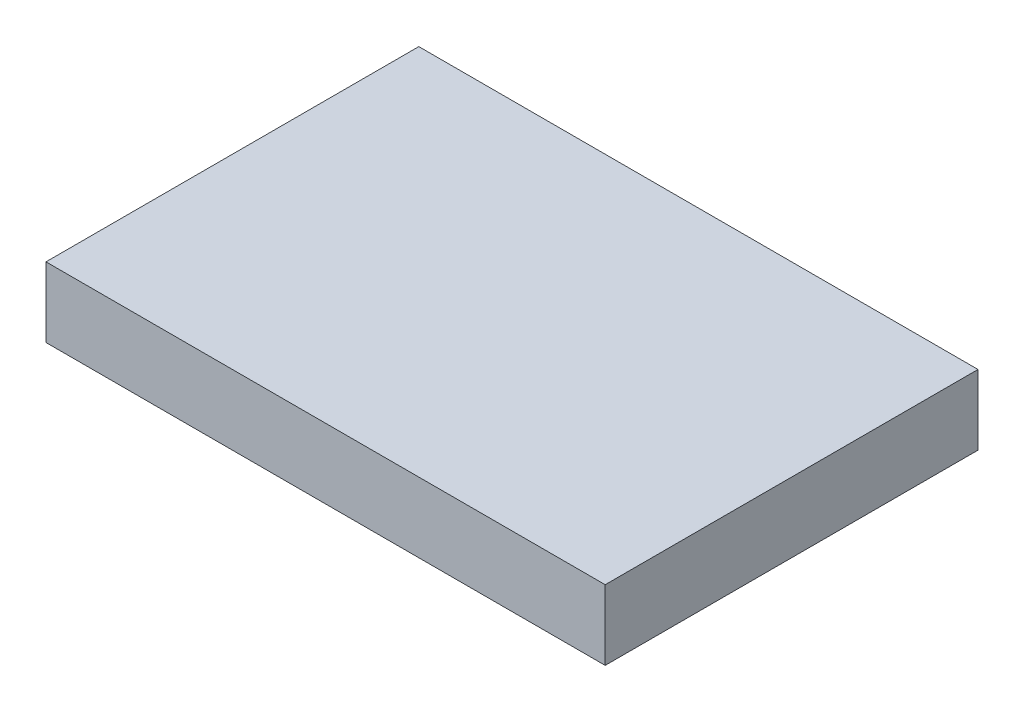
ISO-10303-21;
HEADER;
FILE_DESCRIPTION(('STEP AP214'),'2;1');
FILE_NAME('part.step','',(''),(''),'','','');
FILE_SCHEMA(('AUTOMOTIVE_DESIGN { 1 0 10303 214 1 1 1 1 }'));
ENDSEC;
DATA;
#1=APPLICATION_CONTEXT('core data for automotive mechanical design processes');
#2=APPLICATION_PROTOCOL_DEFINITION('international standard','automotive_design',2000,#1);
#3=PRODUCT_CONTEXT('',#1,'mechanical');
#4=PRODUCT('Part','Part','',(#3));
#5=PRODUCT_RELATED_PRODUCT_CATEGORY('part','',(#4));
#6=PRODUCT_DEFINITION_FORMATION('','',#4);
#7=PRODUCT_DEFINITION_CONTEXT('part definition',#1,'design');
#8=PRODUCT_DEFINITION('design','',#6,#7);
#9=PRODUCT_DEFINITION_SHAPE('','',#8);
#10=(LENGTH_UNIT() NAMED_UNIT(*) SI_UNIT(.MILLI.,.METRE.));
#11=(NAMED_UNIT(*) PLANE_ANGLE_UNIT() SI_UNIT($,.RADIAN.));
#12=(NAMED_UNIT(*) SI_UNIT($,.STERADIAN.) SOLID_ANGLE_UNIT());
#13=UNCERTAINTY_MEASURE_WITH_UNIT(LENGTH_MEASURE(1.E-05),#10,'distance_accuracy_value','');
#14=(GEOMETRIC_REPRESENTATION_CONTEXT(3) GLOBAL_UNCERTAINTY_ASSIGNED_CONTEXT((#13)) GLOBAL_UNIT_ASSIGNED_CONTEXT((#10,
#11,#12)) REPRESENTATION_CONTEXT('',''));
#15=CARTESIAN_POINT('',(0.,0.,0.));
#16=DIRECTION('',(0.,0.,1.));
#17=DIRECTION('',(1.,0.,0.));
#18=AXIS2_PLACEMENT_3D('',#15,#16,#17);
#19=CARTESIAN_POINT('',(0.,19.05,0.));
#20=DIRECTION('',(1.,0.,0.));
#21=DIRECTION('',(0.,0.,-1.));
#22=AXIS2_PLACEMENT_3D('',#19,#20,#21);
#23=PLANE('',#22);
#24=DIRECTION('',(0.,0.,1.));
#25=VECTOR('',#24,1.);
#26=CARTESIAN_POINT('',(0.,0.,0.));
#27=LINE('',#26,#25);
#28=CARTESIAN_POINT('',(0.,0.,-101.6));
#29=VERTEX_POINT('',#28);
#30=CARTESIAN_POINT('',(0.,0.,0.));
#31=VERTEX_POINT('',#30);
#32=EDGE_CURVE('E78',#29,#31,#27,.T.);
#33=ORIENTED_EDGE('',*,*,#32,.T.);
#34=DIRECTION('',(0.,-1.,0.));
#35=VECTOR('',#34,1.);
#36=CARTESIAN_POINT('',(0.,19.05,0.));
#37=LINE('',#36,#35);
#38=CARTESIAN_POINT('',(0.,19.05,0.));
#39=VERTEX_POINT('',#38);
#40=EDGE_CURVE('E11',#39,#31,#37,.T.);
#41=ORIENTED_EDGE('',*,*,#40,.F.);
#42=DIRECTION('',(0.,0.,1.));
#43=VECTOR('',#42,1.);
#44=CARTESIAN_POINT('',(0.,19.05,0.));
#45=LINE('',#44,#43);
#46=CARTESIAN_POINT('',(0.,19.05,-101.6));
#47=VERTEX_POINT('',#46);
#48=EDGE_CURVE('E96',#47,#39,#45,.T.);
#49=ORIENTED_EDGE('',*,*,#48,.F.);
#50=DIRECTION('',(0.,-1.,0.));
#51=VECTOR('',#50,1.);
#52=CARTESIAN_POINT('',(0.,19.05,-101.6));
#53=LINE('',#52,#51);
#54=EDGE_CURVE('E90',#47,#29,#53,.T.);
#55=ORIENTED_EDGE('',*,*,#54,.T.);
#56=EDGE_LOOP('',(#33,#41,#49,#55));
#57=FACE_BOUND('',#56,.T.);
#58=ADVANCED_FACE('F34',(#57),#23,.F.);
#59=CARTESIAN_POINT('',(0.,19.05,0.));
#60=DIRECTION('',(0.,0.,-1.));
#61=DIRECTION('',(-1.,0.,0.));
#62=AXIS2_PLACEMENT_3D('',#59,#60,#61);
#63=PLANE('',#62);
#64=DIRECTION('',(1.,0.,0.));
#65=VECTOR('',#64,1.);
#66=CARTESIAN_POINT('',(0.,0.,0.));
#67=LINE('',#66,#65);
#68=CARTESIAN_POINT('',(152.4,0.,0.));
#69=VERTEX_POINT('',#68);
#70=EDGE_CURVE('E74',#31,#69,#67,.T.);
#71=ORIENTED_EDGE('',*,*,#70,.T.);
#72=DIRECTION('',(0.,-1.,0.));
#73=VECTOR('',#72,1.);
#74=CARTESIAN_POINT('',(152.4,19.05,0.));
#75=LINE('',#74,#73);
#76=CARTESIAN_POINT('',(152.4,19.05,0.));
#77=VERTEX_POINT('',#76);
#78=EDGE_CURVE('E41',#77,#69,#75,.T.);
#79=ORIENTED_EDGE('',*,*,#78,.F.);
#80=DIRECTION('',(1.,0.,0.));
#81=VECTOR('',#80,1.);
#82=CARTESIAN_POINT('',(0.,19.05,0.));
#83=LINE('',#82,#81);
#84=EDGE_CURVE('E86',#39,#77,#83,.T.);
#85=ORIENTED_EDGE('',*,*,#84,.F.);
#86=ORIENTED_EDGE('',*,*,#40,.T.);
#87=EDGE_LOOP('',(#71,#79,#85,#86));
#88=FACE_BOUND('',#87,.T.);
#89=ADVANCED_FACE('F85',(#88),#63,.F.);
#90=CARTESIAN_POINT('',(152.4,19.05,0.));
#91=DIRECTION('',(-1.,0.,0.));
#92=DIRECTION('',(0.,0.,1.));
#93=AXIS2_PLACEMENT_3D('',#90,#91,#92);
#94=PLANE('',#93);
#95=DIRECTION('',(0.,0.,-1.));
#96=VECTOR('',#95,1.);
#97=CARTESIAN_POINT('',(152.4,0.,0.));
#98=LINE('',#97,#96);
#99=CARTESIAN_POINT('',(152.4,0.,-101.6));
#100=VERTEX_POINT('',#99);
#101=EDGE_CURVE('E79',#69,#100,#98,.T.);
#102=ORIENTED_EDGE('',*,*,#101,.T.);
#103=DIRECTION('',(0.,-1.,0.));
#104=VECTOR('',#103,1.);
#105=CARTESIAN_POINT('',(152.4,19.05,-101.6));
#106=LINE('',#105,#104);
#107=CARTESIAN_POINT('',(152.4,19.05,-101.6));
#108=VERTEX_POINT('',#107);
#109=EDGE_CURVE('E102',#108,#100,#106,.T.);
#110=ORIENTED_EDGE('',*,*,#109,.F.);
#111=DIRECTION('',(0.,0.,-1.));
#112=VECTOR('',#111,1.);
#113=CARTESIAN_POINT('',(152.4,19.05,0.));
#114=LINE('',#113,#112);
#115=EDGE_CURVE('E53',#77,#108,#114,.T.);
#116=ORIENTED_EDGE('',*,*,#115,.F.);
#117=ORIENTED_EDGE('',*,*,#78,.T.);
#118=EDGE_LOOP('',(#102,#110,#116,#117));
#119=FACE_BOUND('',#118,.T.);
#120=ADVANCED_FACE('F105',(#119),#94,.F.);
#121=CARTESIAN_POINT('',(0.,19.05,-101.6));
#122=DIRECTION('',(0.,0.,1.));
#123=DIRECTION('',(1.,0.,0.));
#124=AXIS2_PLACEMENT_3D('',#121,#122,#123);
#125=PLANE('',#124);
#126=DIRECTION('',(-1.,0.,0.));
#127=VECTOR('',#126,1.);
#128=CARTESIAN_POINT('',(0.,0.,-101.6));
#129=LINE('',#128,#127);
#130=EDGE_CURVE('E94',#100,#29,#129,.T.);
#131=ORIENTED_EDGE('',*,*,#130,.T.);
#132=ORIENTED_EDGE('',*,*,#54,.F.);
#133=DIRECTION('',(-1.,0.,0.));
#134=VECTOR('',#133,1.);
#135=CARTESIAN_POINT('',(0.,19.05,-101.6));
#136=LINE('',#135,#134);
#137=EDGE_CURVE('E48',#108,#47,#136,.T.);
#138=ORIENTED_EDGE('',*,*,#137,.F.);
#139=ORIENTED_EDGE('',*,*,#109,.T.);
#140=EDGE_LOOP('',(#131,#132,#138,#139));
#141=FACE_BOUND('',#140,.T.);
#142=ADVANCED_FACE('F107',(#141),#125,.F.);
#143=CARTESIAN_POINT('',(0.,19.05,-101.6));
#144=DIRECTION('',(0.,-1.,0.));
#145=DIRECTION('',(0.,0.,-1.));
#146=AXIS2_PLACEMENT_3D('',#143,#144,#145);
#147=PLANE('',#146);
#148=ORIENTED_EDGE('',*,*,#48,.T.);
#149=ORIENTED_EDGE('',*,*,#84,.T.);
#150=ORIENTED_EDGE('',*,*,#115,.T.);
#151=ORIENTED_EDGE('',*,*,#137,.T.);
#152=EDGE_LOOP('',(#148,#149,#150,#151));
#153=FACE_BOUND('',#152,.T.);
#154=ADVANCED_FACE('F108',(#153),#147,.F.);
#155=CARTESIAN_POINT('',(0.,0.,-101.6));
#156=DIRECTION('',(0.,-1.,0.));
#157=DIRECTION('',(0.,0.,-1.));
#158=AXIS2_PLACEMENT_3D('',#155,#156,#157);
#159=PLANE('',#158);
#160=ORIENTED_EDGE('',*,*,#32,.F.);
#161=ORIENTED_EDGE('',*,*,#130,.F.);
#162=ORIENTED_EDGE('',*,*,#101,.F.);
#163=ORIENTED_EDGE('',*,*,#70,.F.);
#164=EDGE_LOOP('',(#160,#161,#162,#163));
#165=FACE_BOUND('',#164,.T.);
#166=ADVANCED_FACE('F75',(#165),#159,.T.);
#167=CLOSED_SHELL('',(#58,#89,#120,#142,#154,#166));
#168=MANIFOLD_SOLID_BREP('B2',#167);
#169=ADVANCED_BREP_SHAPE_REPRESENTATION('',(#18,#168),#14);
#170=SHAPE_DEFINITION_REPRESENTATION(#9,#169);
ENDSEC;
END-ISO-10303-21;
